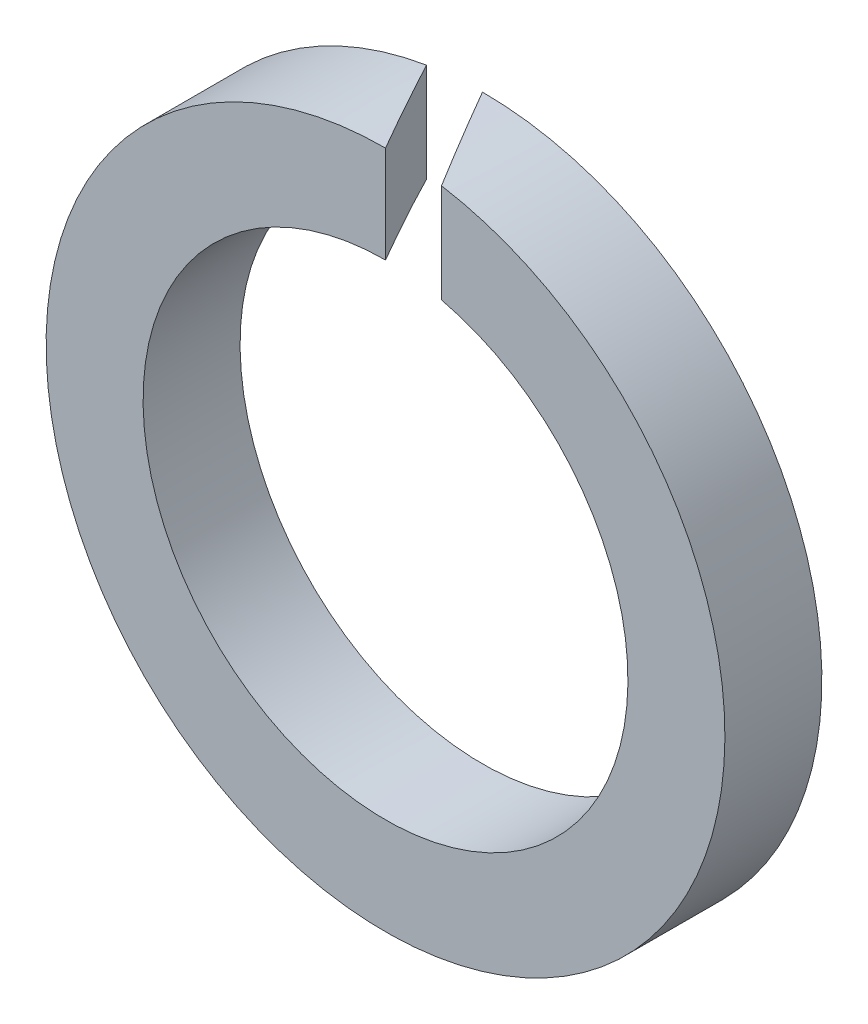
from build123d import *

# Parameters (mm, degrees)
SKETCH1_R          = 2.1
SKETCH1_R_2        = 1.5
BASE_EXTRUDE_DEPTH = 0.6
CUT_EXTRUDE1_DEPTH = 4.029851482


with BuildPart() as part:
    # Sketch1 → Base-Extrude (new body)
    with BuildSketch(Plane.XY):
        Circle(SKETCH1_R)
        Circle(SKETCH1_R_2, mode=Mode.SUBTRACT)
    extrude(amount=-BASE_EXTRUDE_DEPTH)

    # Sketch2 → Cut-Extrude1 (cut, through all)
    with BuildSketch(Plane(origin=(0, 0, 0), x_dir=(1, 0, 0), z_dir=(0, 1, 0))):
        Polygon((0, 0.6), (0.346410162, 0), (0, 0), (-0.346410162, 0.6), align=None)
    extrude(amount=CUT_EXTRUDE1_DEPTH, mode=Mode.SUBTRACT)


solid = part.part
